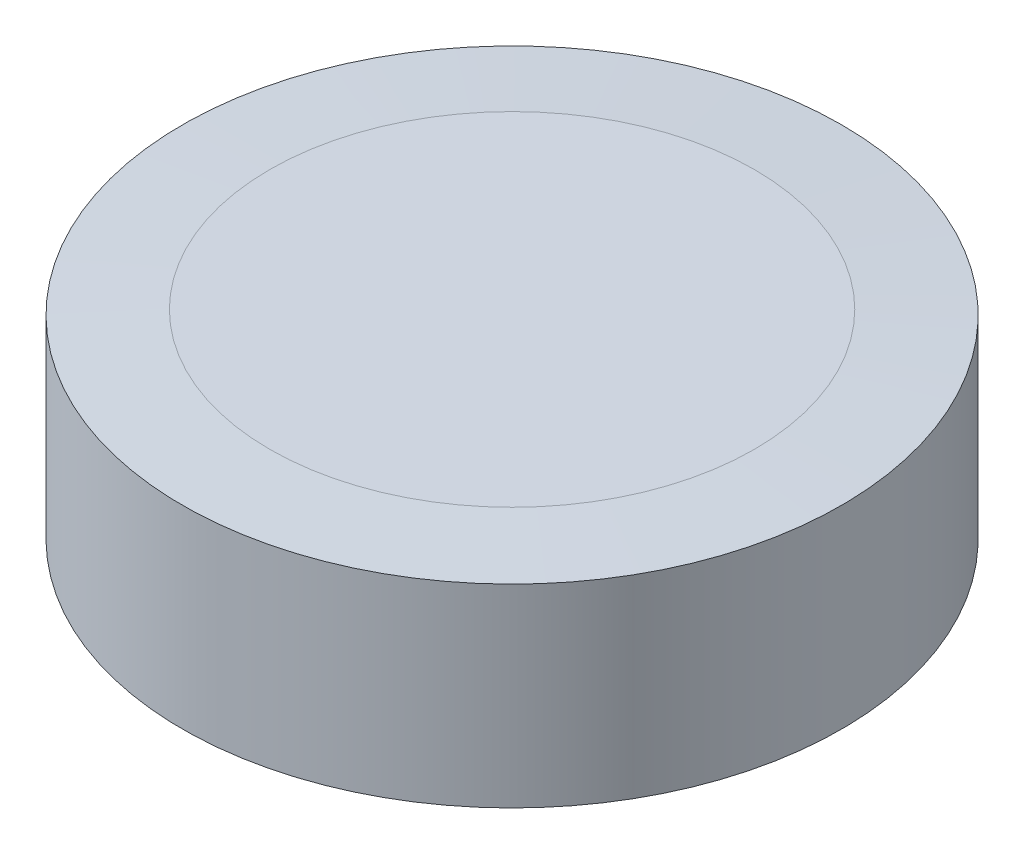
ISO-10303-21;
HEADER;
FILE_DESCRIPTION(('STEP AP214'),'2;1');
FILE_NAME('part.step','',(''),(''),'','','');
FILE_SCHEMA(('AUTOMOTIVE_DESIGN { 1 0 10303 214 1 1 1 1 }'));
ENDSEC;
DATA;
#1=APPLICATION_CONTEXT('core data for automotive mechanical design processes');
#2=APPLICATION_PROTOCOL_DEFINITION('international standard','automotive_design',2000,#1);
#3=PRODUCT_CONTEXT('',#1,'mechanical');
#4=PRODUCT('Part','Part','',(#3));
#5=PRODUCT_RELATED_PRODUCT_CATEGORY('part','',(#4));
#6=PRODUCT_DEFINITION_FORMATION('','',#4);
#7=PRODUCT_DEFINITION_CONTEXT('part definition',#1,'design');
#8=PRODUCT_DEFINITION('design','',#6,#7);
#9=PRODUCT_DEFINITION_SHAPE('','',#8);
#10=(LENGTH_UNIT() NAMED_UNIT(*) SI_UNIT(.MILLI.,.METRE.));
#11=(NAMED_UNIT(*) PLANE_ANGLE_UNIT() SI_UNIT($,.RADIAN.));
#12=(NAMED_UNIT(*) SI_UNIT($,.STERADIAN.) SOLID_ANGLE_UNIT());
#13=UNCERTAINTY_MEASURE_WITH_UNIT(LENGTH_MEASURE(1.E-05),#10,'distance_accuracy_value','');
#14=(GEOMETRIC_REPRESENTATION_CONTEXT(3) GLOBAL_UNCERTAINTY_ASSIGNED_CONTEXT((#13)) GLOBAL_UNIT_ASSIGNED_CONTEXT((#10,
#11,#12)) REPRESENTATION_CONTEXT('',''));
#15=CARTESIAN_POINT('',(0.,0.,0.));
#16=DIRECTION('',(0.,0.,1.));
#17=DIRECTION('',(1.,0.,0.));
#18=AXIS2_PLACEMENT_3D('',#15,#16,#17);
#19=CARTESIAN_POINT('',(0.,5.25,0.));
#20=DIRECTION('',(0.,-1.,0.));
#21=DIRECTION('',(0.,0.,-1.));
#22=AXIS2_PLACEMENT_3D('',#19,#20,#21);
#23=PLANE('',#22);
#24=CARTESIAN_POINT('',(0.,5.25,0.));
#25=DIRECTION('',(0.,-1.,0.));
#26=DIRECTION('',(0.,0.,-1.));
#27=AXIS2_PLACEMENT_3D('',#24,#25,#26);
#28=CIRCLE('',#27,12.5);
#29=CARTESIAN_POINT('',(0.,5.25,-12.5));
#30=VERTEX_POINT('',#29);
#31=EDGE_CURVE('E10',#30,#30,#28,.T.);
#32=ORIENTED_EDGE('',*,*,#31,.F.);
#33=EDGE_LOOP('',(#32));
#34=FACE_BOUND('',#33,.T.);
#35=ADVANCED_FACE('F32',(#34),#23,.F.);
#36=CARTESIAN_POINT('',(0.,5.25,0.));
#37=DIRECTION('',(0.,-1.,0.));
#38=DIRECTION('',(0.,0.,-1.));
#39=AXIS2_PLACEMENT_3D('',#36,#37,#38);
#40=CONICAL_SURFACE('',#39,12.5,1.51529782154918);
#41=CARTESIAN_POINT('',(0.,5.,0.));
#42=DIRECTION('',(0.,-1.,0.));
#43=DIRECTION('',(0.,0.,-1.));
#44=AXIS2_PLACEMENT_3D('',#41,#42,#43);
#45=CIRCLE('',#44,17.);
#46=CARTESIAN_POINT('',(0.,5.,-17.));
#47=VERTEX_POINT('',#46);
#48=EDGE_CURVE('E38',#47,#47,#45,.T.);
#49=ORIENTED_EDGE('',*,*,#48,.F.);
#50=EDGE_LOOP('',(#49));
#51=FACE_BOUND('',#50,.T.);
#52=ORIENTED_EDGE('',*,*,#31,.T.);
#53=EDGE_LOOP('',(#52));
#54=FACE_BOUND('',#53,.T.);
#55=ADVANCED_FACE('F64',(#51,#54),#40,.T.);
#56=CARTESIAN_POINT('',(0.,-5.25,0.));
#57=DIRECTION('',(0.,-1.,0.));
#58=DIRECTION('',(0.,0.,-1.));
#59=AXIS2_PLACEMENT_3D('',#56,#57,#58);
#60=CYLINDRICAL_SURFACE('',#59,17.);
#61=CARTESIAN_POINT('',(0.,-5.,0.));
#62=DIRECTION('',(0.,-1.,0.));
#63=DIRECTION('',(0.,0.,-1.));
#64=AXIS2_PLACEMENT_3D('',#61,#62,#63);
#65=CIRCLE('',#64,17.);
#66=CARTESIAN_POINT('',(0.,-5.,-17.));
#67=VERTEX_POINT('',#66);
#68=EDGE_CURVE('E42',#67,#67,#65,.T.);
#69=ORIENTED_EDGE('',*,*,#68,.F.);
#70=EDGE_LOOP('',(#69));
#71=FACE_BOUND('',#70,.T.);
#72=ORIENTED_EDGE('',*,*,#48,.T.);
#73=EDGE_LOOP('',(#72));
#74=FACE_BOUND('',#73,.T.);
#75=ADVANCED_FACE('F59',(#71,#74),#60,.T.);
#76=CARTESIAN_POINT('',(0.,-5.,0.));
#77=DIRECTION('',(0.,1.,0.));
#78=DIRECTION('',(0.,0.,1.));
#79=AXIS2_PLACEMENT_3D('',#76,#77,#78);
#80=CONICAL_SURFACE('',#79,17.,1.51529782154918);
#81=CARTESIAN_POINT('',(0.,-5.25,0.));
#82=DIRECTION('',(0.,-1.,0.));
#83=DIRECTION('',(0.,0.,-1.));
#84=AXIS2_PLACEMENT_3D('',#81,#82,#83);
#85=CIRCLE('',#84,12.5);
#86=CARTESIAN_POINT('',(0.,-5.25,-12.5));
#87=VERTEX_POINT('',#86);
#88=EDGE_CURVE('E47',#87,#87,#85,.T.);
#89=ORIENTED_EDGE('',*,*,#88,.F.);
#90=EDGE_LOOP('',(#89));
#91=FACE_BOUND('',#90,.T.);
#92=ORIENTED_EDGE('',*,*,#68,.T.);
#93=EDGE_LOOP('',(#92));
#94=FACE_BOUND('',#93,.T.);
#95=ADVANCED_FACE('F56',(#91,#94),#80,.T.);
#96=CARTESIAN_POINT('',(0.,-5.25,0.));
#97=DIRECTION('',(0.,1.,0.));
#98=DIRECTION('',(0.,0.,1.));
#99=AXIS2_PLACEMENT_3D('',#96,#97,#98);
#100=PLANE('',#99);
#101=ORIENTED_EDGE('',*,*,#88,.T.);
#102=EDGE_LOOP('',(#101));
#103=FACE_BOUND('',#102,.T.);
#104=ADVANCED_FACE('F54',(#103),#100,.F.);
#105=CLOSED_SHELL('',(#35,#55,#75,#95,#104));
#106=MANIFOLD_SOLID_BREP('B2',#105);
#107=ADVANCED_BREP_SHAPE_REPRESENTATION('',(#18,#106),#14);
#108=SHAPE_DEFINITION_REPRESENTATION(#9,#107);
ENDSEC;
END-ISO-10303-21;
